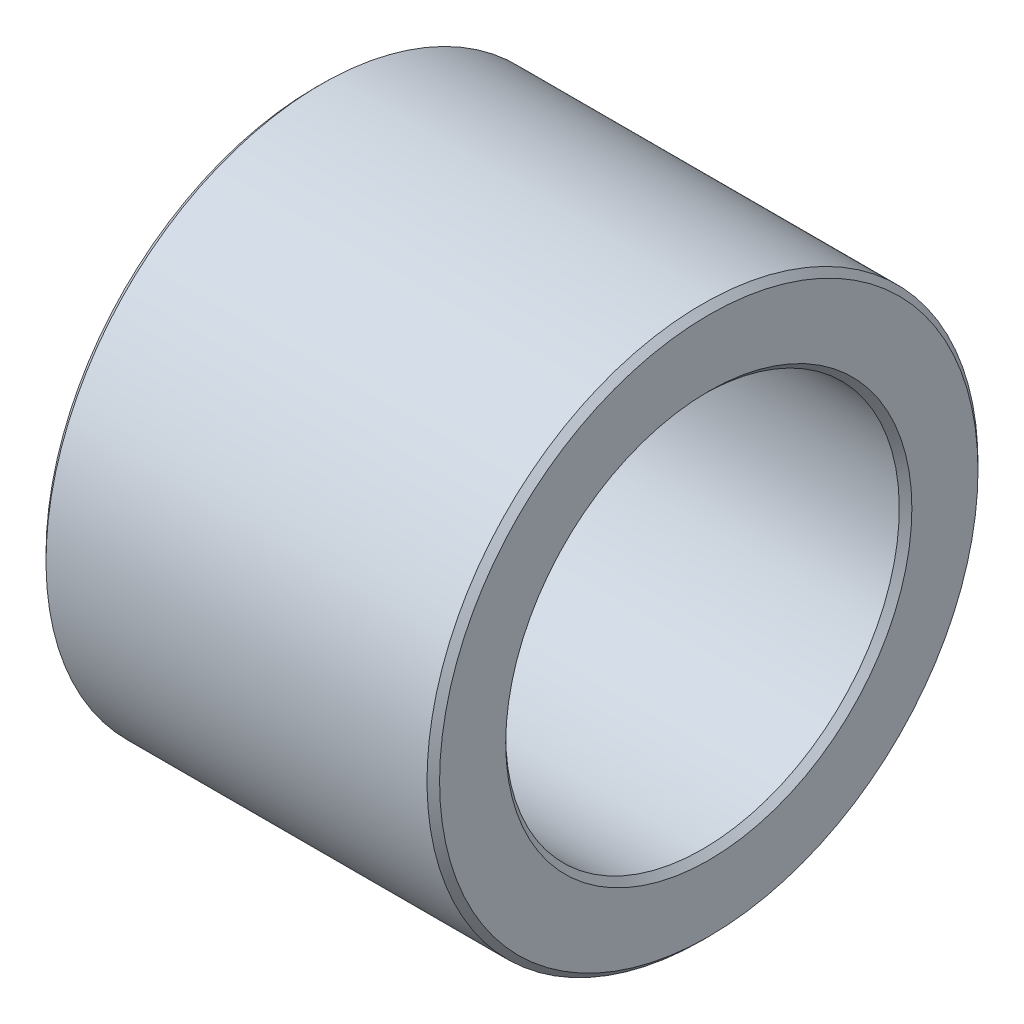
ISO-10303-21;
HEADER;
FILE_DESCRIPTION(('STEP AP214'),'2;1');
FILE_NAME('part.step','',(''),(''),'','','');
FILE_SCHEMA(('AUTOMOTIVE_DESIGN { 1 0 10303 214 1 1 1 1 }'));
ENDSEC;
DATA;
#1=APPLICATION_CONTEXT('core data for automotive mechanical design processes');
#2=APPLICATION_PROTOCOL_DEFINITION('international standard','automotive_design',2000,#1);
#3=PRODUCT_CONTEXT('',#1,'mechanical');
#4=PRODUCT('Part','Part','',(#3));
#5=PRODUCT_RELATED_PRODUCT_CATEGORY('part','',(#4));
#6=PRODUCT_DEFINITION_FORMATION('','',#4);
#7=PRODUCT_DEFINITION_CONTEXT('part definition',#1,'design');
#8=PRODUCT_DEFINITION('design','',#6,#7);
#9=PRODUCT_DEFINITION_SHAPE('','',#8);
#10=(LENGTH_UNIT() NAMED_UNIT(*) SI_UNIT(.MILLI.,.METRE.));
#11=(NAMED_UNIT(*) PLANE_ANGLE_UNIT() SI_UNIT($,.RADIAN.));
#12=(NAMED_UNIT(*) SI_UNIT($,.STERADIAN.) SOLID_ANGLE_UNIT());
#13=UNCERTAINTY_MEASURE_WITH_UNIT(LENGTH_MEASURE(1.E-05),#10,'distance_accuracy_value','');
#14=(GEOMETRIC_REPRESENTATION_CONTEXT(3) GLOBAL_UNCERTAINTY_ASSIGNED_CONTEXT((#13)) GLOBAL_UNIT_ASSIGNED_CONTEXT((#10,
#11,#12)) REPRESENTATION_CONTEXT('',''));
#15=CARTESIAN_POINT('',(0.,0.,0.));
#16=DIRECTION('',(0.,0.,1.));
#17=DIRECTION('',(1.,0.,0.));
#18=AXIS2_PLACEMENT_3D('',#15,#16,#17);
#19=CARTESIAN_POINT('',(0.,-15.,0.));
#20=DIRECTION('',(-1.,0.,0.));
#21=DIRECTION('',(0.,1.,0.));
#22=AXIS2_PLACEMENT_3D('',#19,#20,#21);
#23=PLANE('',#22);
#24=CARTESIAN_POINT('',(0.,0.,0.));
#25=DIRECTION('',(1.,0.,0.));
#26=DIRECTION('',(0.,-1.,0.));
#27=AXIS2_PLACEMENT_3D('',#24,#25,#26);
#28=CIRCLE('',#27,12.9);
#29=CARTESIAN_POINT('',(0.,-12.9,0.));
#30=VERTEX_POINT('',#29);
#31=EDGE_CURVE('E9',#30,#30,#28,.T.);
#32=ORIENTED_EDGE('',*,*,#31,.T.);
#33=EDGE_LOOP('',(#32));
#34=FACE_BOUND('',#33,.T.);
#35=CARTESIAN_POINT('',(0.,0.,0.));
#36=DIRECTION('',(1.,0.,0.));
#37=DIRECTION('',(0.,-1.,0.));
#38=AXIS2_PLACEMENT_3D('',#35,#36,#37);
#39=CIRCLE('',#38,17.1);
#40=CARTESIAN_POINT('',(0.,-17.1,0.));
#41=VERTEX_POINT('',#40);
#42=EDGE_CURVE('E53',#41,#41,#39,.T.);
#43=ORIENTED_EDGE('',*,*,#42,.F.);
#44=EDGE_LOOP('',(#43));
#45=FACE_BOUND('',#44,.T.);
#46=ADVANCED_FACE('F15',(#34,#45),#23,.T.);
#47=CARTESIAN_POINT('',(0.2,0.,0.));
#48=DIRECTION('',(-1.,0.,0.));
#49=DIRECTION('',(0.,-1.,0.));
#50=AXIS2_PLACEMENT_3D('',#47,#48,#49);
#51=CONICAL_SURFACE('',#50,12.7,0.78539816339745);
#52=CARTESIAN_POINT('',(0.4,0.,0.));
#53=DIRECTION('',(1.,0.,0.));
#54=DIRECTION('',(0.,-1.,0.));
#55=AXIS2_PLACEMENT_3D('',#52,#53,#54);
#56=CIRCLE('',#55,12.5);
#57=CARTESIAN_POINT('',(0.4,-12.5,0.));
#58=VERTEX_POINT('',#57);
#59=EDGE_CURVE('E22',#58,#58,#56,.T.);
#60=ORIENTED_EDGE('',*,*,#59,.T.);
#61=EDGE_LOOP('',(#60));
#62=FACE_BOUND('',#61,.T.);
#63=ORIENTED_EDGE('',*,*,#31,.F.);
#64=EDGE_LOOP('',(#63));
#65=FACE_BOUND('',#64,.T.);
#66=ADVANCED_FACE('F82',(#62,#65),#51,.F.);
#67=CARTESIAN_POINT('',(12.5,0.,0.));
#68=DIRECTION('',(-1.,0.,0.));
#69=DIRECTION('',(0.,-1.,0.));
#70=AXIS2_PLACEMENT_3D('',#67,#68,#69);
#71=CYLINDRICAL_SURFACE('',#70,12.5);
#72=CARTESIAN_POINT('',(24.6,0.,0.));
#73=DIRECTION('',(1.,0.,0.));
#74=DIRECTION('',(0.,-1.,0.));
#75=AXIS2_PLACEMENT_3D('',#72,#73,#74);
#76=CIRCLE('',#75,12.5);
#77=CARTESIAN_POINT('',(24.6,-12.5,0.));
#78=VERTEX_POINT('',#77);
#79=EDGE_CURVE('E58',#78,#78,#76,.T.);
#80=ORIENTED_EDGE('',*,*,#79,.T.);
#81=EDGE_LOOP('',(#80));
#82=FACE_BOUND('',#81,.T.);
#83=ORIENTED_EDGE('',*,*,#59,.F.);
#84=EDGE_LOOP('',(#83));
#85=FACE_BOUND('',#84,.T.);
#86=ADVANCED_FACE('F66',(#82,#85),#71,.F.);
#87=CARTESIAN_POINT('',(24.8,0.,0.));
#88=DIRECTION('',(1.,0.,0.));
#89=DIRECTION('',(0.,-1.,0.));
#90=AXIS2_PLACEMENT_3D('',#87,#88,#89);
#91=CONICAL_SURFACE('',#90,12.7,0.785398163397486);
#92=CARTESIAN_POINT('',(25.,0.,0.));
#93=DIRECTION('',(1.,0.,0.));
#94=DIRECTION('',(0.,-1.,0.));
#95=AXIS2_PLACEMENT_3D('',#92,#93,#94);
#96=CIRCLE('',#95,12.9);
#97=CARTESIAN_POINT('',(25.,-12.9,0.));
#98=VERTEX_POINT('',#97);
#99=EDGE_CURVE('E63',#98,#98,#96,.T.);
#100=ORIENTED_EDGE('',*,*,#99,.T.);
#101=EDGE_LOOP('',(#100));
#102=FACE_BOUND('',#101,.T.);
#103=ORIENTED_EDGE('',*,*,#79,.F.);
#104=EDGE_LOOP('',(#103));
#105=FACE_BOUND('',#104,.T.);
#106=ADVANCED_FACE('F69',(#102,#105),#91,.F.);
#107=CARTESIAN_POINT('',(25.,-15.,0.));
#108=DIRECTION('',(1.,0.,0.));
#109=DIRECTION('',(0.,-1.,0.));
#110=AXIS2_PLACEMENT_3D('',#107,#108,#109);
#111=PLANE('',#110);
#112=CARTESIAN_POINT('',(25.,0.,0.));
#113=DIRECTION('',(1.,0.,0.));
#114=DIRECTION('',(0.,-1.,0.));
#115=AXIS2_PLACEMENT_3D('',#112,#113,#114);
#116=CIRCLE('',#115,17.1);
#117=CARTESIAN_POINT('',(25.,-17.1,0.));
#118=VERTEX_POINT('',#117);
#119=EDGE_CURVE('E61',#118,#118,#116,.T.);
#120=ORIENTED_EDGE('',*,*,#119,.T.);
#121=EDGE_LOOP('',(#120));
#122=FACE_BOUND('',#121,.T.);
#123=ORIENTED_EDGE('',*,*,#99,.F.);
#124=EDGE_LOOP('',(#123));
#125=FACE_BOUND('',#124,.T.);
#126=ADVANCED_FACE('F71',(#122,#125),#111,.T.);
#127=CARTESIAN_POINT('',(24.8,0.,0.));
#128=DIRECTION('',(-1.,0.,0.));
#129=DIRECTION('',(0.,-1.,0.));
#130=AXIS2_PLACEMENT_3D('',#127,#128,#129);
#131=CONICAL_SURFACE('',#130,17.3,0.785398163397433);
#132=CARTESIAN_POINT('',(24.6,0.,0.));
#133=DIRECTION('',(1.,0.,0.));
#134=DIRECTION('',(0.,-1.,0.));
#135=AXIS2_PLACEMENT_3D('',#132,#133,#134);
#136=CIRCLE('',#135,17.5);
#137=CARTESIAN_POINT('',(24.6,-17.5,0.));
#138=VERTEX_POINT('',#137);
#139=EDGE_CURVE('E55',#138,#138,#136,.T.);
#140=ORIENTED_EDGE('',*,*,#139,.T.);
#141=EDGE_LOOP('',(#140));
#142=FACE_BOUND('',#141,.T.);
#143=ORIENTED_EDGE('',*,*,#119,.F.);
#144=EDGE_LOOP('',(#143));
#145=FACE_BOUND('',#144,.T.);
#146=ADVANCED_FACE('F79',(#142,#145),#131,.T.);
#147=CARTESIAN_POINT('',(12.5,0.,0.));
#148=DIRECTION('',(-1.,0.,0.));
#149=DIRECTION('',(0.,-1.,0.));
#150=AXIS2_PLACEMENT_3D('',#147,#148,#149);
#151=CYLINDRICAL_SURFACE('',#150,17.5);
#152=CARTESIAN_POINT('',(0.4,0.,0.));
#153=DIRECTION('',(1.,0.,0.));
#154=DIRECTION('',(0.,-1.,0.));
#155=AXIS2_PLACEMENT_3D('',#152,#153,#154);
#156=CIRCLE('',#155,17.5);
#157=CARTESIAN_POINT('',(0.4,-17.5,0.));
#158=VERTEX_POINT('',#157);
#159=EDGE_CURVE('E49',#158,#158,#156,.T.);
#160=ORIENTED_EDGE('',*,*,#159,.T.);
#161=EDGE_LOOP('',(#160));
#162=FACE_BOUND('',#161,.T.);
#163=ORIENTED_EDGE('',*,*,#139,.F.);
#164=EDGE_LOOP('',(#163));
#165=FACE_BOUND('',#164,.T.);
#166=ADVANCED_FACE('F50',(#162,#165),#151,.T.);
#167=CARTESIAN_POINT('',(0.2,0.,0.));
#168=DIRECTION('',(1.,0.,0.));
#169=DIRECTION('',(0.,-1.,0.));
#170=AXIS2_PLACEMENT_3D('',#167,#168,#169);
#171=CONICAL_SURFACE('',#170,17.3,0.78539816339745);
#172=ORIENTED_EDGE('',*,*,#42,.T.);
#173=EDGE_LOOP('',(#172));
#174=FACE_BOUND('',#173,.T.);
#175=ORIENTED_EDGE('',*,*,#159,.F.);
#176=EDGE_LOOP('',(#175));
#177=FACE_BOUND('',#176,.T.);
#178=ADVANCED_FACE('F92',(#174,#177),#171,.T.);
#179=CLOSED_SHELL('',(#46,#66,#86,#106,#126,#146,#166,#178));
#180=MANIFOLD_SOLID_BREP('B1',#179);
#181=ADVANCED_BREP_SHAPE_REPRESENTATION('',(#18,#180),#14);
#182=SHAPE_DEFINITION_REPRESENTATION(#9,#181);
ENDSEC;
END-ISO-10303-21;
